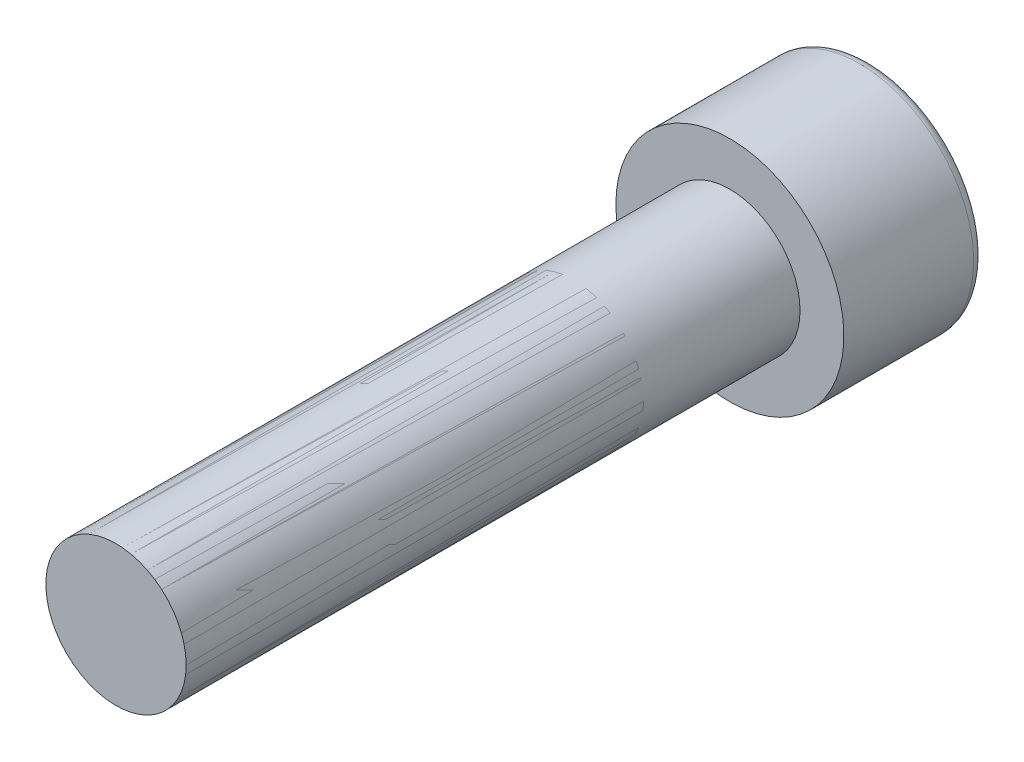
ISO-10303-21;
HEADER;
FILE_DESCRIPTION(('STEP AP214'),'2;1');
FILE_NAME('part.step','',(''),(''),'','','');
FILE_SCHEMA(('AUTOMOTIVE_DESIGN { 1 0 10303 214 1 1 1 1 }'));
ENDSEC;
DATA;
#1=APPLICATION_CONTEXT('core data for automotive mechanical design processes');
#2=APPLICATION_PROTOCOL_DEFINITION('international standard','automotive_design',2000,#1);
#3=PRODUCT_CONTEXT('',#1,'mechanical');
#4=PRODUCT('Part','Part','',(#3));
#5=PRODUCT_RELATED_PRODUCT_CATEGORY('part','',(#4));
#6=PRODUCT_DEFINITION_FORMATION('','',#4);
#7=PRODUCT_DEFINITION_CONTEXT('part definition',#1,'design');
#8=PRODUCT_DEFINITION('design','',#6,#7);
#9=PRODUCT_DEFINITION_SHAPE('','',#8);
#10=(LENGTH_UNIT() NAMED_UNIT(*) SI_UNIT(.MILLI.,.METRE.));
#11=(NAMED_UNIT(*) PLANE_ANGLE_UNIT() SI_UNIT($,.RADIAN.));
#12=(NAMED_UNIT(*) SI_UNIT($,.STERADIAN.) SOLID_ANGLE_UNIT());
#13=UNCERTAINTY_MEASURE_WITH_UNIT(LENGTH_MEASURE(1.E-05),#10,'distance_accuracy_value','');
#14=(GEOMETRIC_REPRESENTATION_CONTEXT(3) GLOBAL_UNCERTAINTY_ASSIGNED_CONTEXT((#13)) GLOBAL_UNIT_ASSIGNED_CONTEXT((#10,
#11,#12)) REPRESENTATION_CONTEXT('',''));
#15=CARTESIAN_POINT('',(0.,0.,0.));
#16=DIRECTION('',(0.,0.,1.));
#17=DIRECTION('',(1.,0.,0.));
#18=AXIS2_PLACEMENT_3D('',#15,#16,#17);
#19=CARTESIAN_POINT('',(0.,0.,35.));
#20=DIRECTION('',(0.,0.,1.));
#21=DIRECTION('',(1.,0.,0.));
#22=AXIS2_PLACEMENT_3D('',#19,#20,#21);
#23=CYLINDRICAL_SURFACE('',#22,4.);
#24=CARTESIAN_POINT('',(0.,0.,0.));
#25=DIRECTION('',(0.,0.,1.));
#26=DIRECTION('',(1.,0.,0.));
#27=AXIS2_PLACEMENT_3D('',#24,#25,#26);
#28=CIRCLE('',#27,4.);
#29=CARTESIAN_POINT('',(4.,0.,0.));
#30=VERTEX_POINT('',#29);
#31=EDGE_CURVE('P0_E18',#30,#30,#28,.T.);
#32=ORIENTED_EDGE('',*,*,#31,.T.);
#33=EDGE_LOOP('',(#32));
#34=FACE_BOUND('',#33,.T.);
#35=CARTESIAN_POINT('',(0.,0.,35.));
#36=DIRECTION('',(0.,0.,1.));
#37=DIRECTION('',(1.,0.,0.));
#38=AXIS2_PLACEMENT_3D('',#35,#36,#37);
#39=CIRCLE('',#38,4.);
#40=CARTESIAN_POINT('',(4.,0.,35.));
#41=VERTEX_POINT('',#40);
#42=EDGE_CURVE('P0_E10',#41,#41,#39,.F.);
#43=ORIENTED_EDGE('',*,*,#42,.T.);
#44=EDGE_LOOP('',(#43));
#45=FACE_BOUND('',#44,.T.);
#46=ADVANCED_FACE('P0_F15',(#34,#45),#23,.T.);
#47=CARTESIAN_POINT('',(0.,0.,0.));
#48=DIRECTION('',(0.,0.,1.));
#49=DIRECTION('',(1.,0.,0.));
#50=AXIS2_PLACEMENT_3D('',#47,#48,#49);
#51=PLANE('',#50);
#52=ORIENTED_EDGE('',*,*,#31,.F.);
#53=EDGE_LOOP('',(#52));
#54=FACE_BOUND('',#53,.T.);
#55=ADVANCED_FACE('P0_F16',(#54),#51,.F.);
#56=OPEN_SHELL('',(#46,#55));
#57=SHELL_BASED_SURFACE_MODEL('P0_B1',(#56));
#58=CARTESIAN_POINT('',(0.,0.,-2.666666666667));
#59=DIRECTION('',(0.,0.,-1.));
#60=DIRECTION('',(-1.,0.,0.));
#61=AXIS2_PLACEMENT_3D('',#58,#59,#60);
#62=PLANE('',#61);
#63=DIRECTION('',(-0.500000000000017,0.866025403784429,0.));
#64=VECTOR('',#63,1.);
#65=CARTESIAN_POINT('',(1.732050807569,3.,-2.666666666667));
#66=LINE('',#65,#64);
#67=CARTESIAN_POINT('',(1.732050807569,3.,-2.666666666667));
#68=VERTEX_POINT('',#67);
#69=CARTESIAN_POINT('',(3.46410161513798,0.,-2.666666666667));
#70=VERTEX_POINT('',#69);
#71=EDGE_CURVE('P1_E65',#68,#70,#66,.F.);
#72=ORIENTED_EDGE('',*,*,#71,.T.);
#73=DIRECTION('',(0.500000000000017,0.866025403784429,0.));
#74=VECTOR('',#73,1.);
#75=CARTESIAN_POINT('',(3.464101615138,0.,-2.666666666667));
#76=LINE('',#75,#74);
#77=CARTESIAN_POINT('',(1.73205080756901,-3.00000000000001,-2.666666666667));
#78=VERTEX_POINT('',#77);
#79=EDGE_CURVE('P1_E167',#70,#78,#76,.F.);
#80=ORIENTED_EDGE('',*,*,#79,.T.);
#81=DIRECTION('',(1.,0.,0.));
#82=VECTOR('',#81,1.);
#83=CARTESIAN_POINT('',(1.732050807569,-3.,-2.666666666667));
#84=LINE('',#83,#82);
#85=CARTESIAN_POINT('',(-1.732050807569,-3.,-2.666666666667));
#86=VERTEX_POINT('',#85);
#87=EDGE_CURVE('P1_E173',#78,#86,#84,.F.);
#88=ORIENTED_EDGE('',*,*,#87,.T.);
#89=DIRECTION('',(0.500000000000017,-0.866025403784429,0.));
#90=VECTOR('',#89,1.);
#91=CARTESIAN_POINT('',(-1.732050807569,-3.,-2.666666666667));
#92=LINE('',#91,#90);
#93=CARTESIAN_POINT('',(-3.46410161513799,0.,-2.666666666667));
#94=VERTEX_POINT('',#93);
#95=EDGE_CURVE('P1_E178',#86,#94,#92,.F.);
#96=ORIENTED_EDGE('',*,*,#95,.T.);
#97=DIRECTION('',(-0.500000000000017,-0.866025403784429,0.));
#98=VECTOR('',#97,1.);
#99=CARTESIAN_POINT('',(-3.464101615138,0.,-2.666666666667));
#100=LINE('',#99,#98);
#101=CARTESIAN_POINT('',(-1.73205080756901,3.00000000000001,-2.666666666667));
#102=VERTEX_POINT('',#101);
#103=EDGE_CURVE('P1_E61',#94,#102,#100,.F.);
#104=ORIENTED_EDGE('',*,*,#103,.T.);
#105=DIRECTION('',(1.,0.,0.));
#106=VECTOR('',#105,1.);
#107=CARTESIAN_POINT('',(-1.732050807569,3.,-2.666666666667));
#108=LINE('',#107,#106);
#109=EDGE_CURVE('P1_E63',#102,#68,#108,.T.);
#110=ORIENTED_EDGE('',*,*,#109,.T.);
#111=EDGE_LOOP('',(#72,#80,#88,#96,#104,#110));
#112=FACE_BOUND('',#111,.T.);
#113=ADVANCED_FACE('P1_F17',(#112),#62,.T.);
#114=CARTESIAN_POINT('',(1.732050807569,3.,-8.));
#115=DIRECTION('',(0.866025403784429,0.500000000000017,0.));
#116=DIRECTION('',(-0.500000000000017,0.866025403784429,0.));
#117=AXIS2_PLACEMENT_3D('',#114,#115,#116);
#118=PLANE('',#117);
#119=ORIENTED_EDGE('',*,*,#71,.F.);
#120=DIRECTION('',(0.,0.,1.));
#121=VECTOR('',#120,1.);
#122=CARTESIAN_POINT('',(1.732050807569,3.,-8.));
#123=LINE('',#122,#121);
#124=CARTESIAN_POINT('',(1.732050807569,3.,-8.));
#125=VERTEX_POINT('',#124);
#126=EDGE_CURVE('P1_E71',#68,#125,#123,.F.);
#127=ORIENTED_EDGE('',*,*,#126,.T.);
#128=DIRECTION('',(-0.500000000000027,0.866025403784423,0.));
#129=VECTOR('',#128,1.);
#130=CARTESIAN_POINT('',(3.464101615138,0.,-8.));
#131=LINE('',#130,#129);
#132=CARTESIAN_POINT('',(3.46410161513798,0.,-8.));
#133=VERTEX_POINT('',#132);
#134=EDGE_CURVE('P1_E153',#133,#125,#131,.T.);
#135=ORIENTED_EDGE('',*,*,#134,.F.);
#136=DIRECTION('',(0.,0.,1.));
#137=VECTOR('',#136,1.);
#138=CARTESIAN_POINT('',(3.464101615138,0.,-8.));
#139=LINE('',#138,#137);
#140=EDGE_CURVE('P1_E79',#133,#70,#139,.T.);
#141=ORIENTED_EDGE('',*,*,#140,.T.);
#142=EDGE_LOOP('',(#119,#127,#135,#141));
#143=FACE_BOUND('',#142,.T.);
#144=ADVANCED_FACE('P1_F75',(#143),#118,.F.);
#145=CARTESIAN_POINT('',(-1.732050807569,3.,-8.));
#146=DIRECTION('',(0.,1.,0.));
#147=DIRECTION('',(0.,0.,1.));
#148=AXIS2_PLACEMENT_3D('',#145,#146,#147);
#149=PLANE('',#148);
#150=ORIENTED_EDGE('',*,*,#109,.F.);
#151=DIRECTION('',(0.,0.,1.));
#152=VECTOR('',#151,1.);
#153=CARTESIAN_POINT('',(-1.73205080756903,3.00000000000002,-8.));
#154=LINE('',#153,#152);
#155=CARTESIAN_POINT('',(-1.73205080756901,3.00000000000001,-8.));
#156=VERTEX_POINT('',#155);
#157=EDGE_CURVE('P1_E87',#102,#156,#154,.F.);
#158=ORIENTED_EDGE('',*,*,#157,.T.);
#159=DIRECTION('',(-1.,0.,0.));
#160=VECTOR('',#159,1.);
#161=CARTESIAN_POINT('',(0.,3.,-8.));
#162=LINE('',#161,#160);
#163=EDGE_CURVE('P1_E84',#125,#156,#162,.T.);
#164=ORIENTED_EDGE('',*,*,#163,.F.);
#165=ORIENTED_EDGE('',*,*,#126,.F.);
#166=EDGE_LOOP('',(#150,#158,#164,#165));
#167=FACE_BOUND('',#166,.T.);
#168=ADVANCED_FACE('P1_F82',(#167),#149,.F.);
#169=CARTESIAN_POINT('',(-3.464101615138,0.,-8.));
#170=DIRECTION('',(-0.866025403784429,0.500000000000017,0.));
#171=DIRECTION('',(-0.500000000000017,-0.866025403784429,0.));
#172=AXIS2_PLACEMENT_3D('',#169,#170,#171);
#173=PLANE('',#172);
#174=ORIENTED_EDGE('',*,*,#103,.F.);
#175=DIRECTION('',(0.,0.,1.));
#176=VECTOR('',#175,1.);
#177=CARTESIAN_POINT('',(-3.46410161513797,0.,-8.));
#178=LINE('',#177,#176);
#179=CARTESIAN_POINT('',(-3.46410161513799,0.,-8.));
#180=VERTEX_POINT('',#179);
#181=EDGE_CURVE('P1_E175',#94,#180,#178,.F.);
#182=ORIENTED_EDGE('',*,*,#181,.T.);
#183=DIRECTION('',(-0.500000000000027,-0.866025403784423,0.));
#184=VECTOR('',#183,1.);
#185=CARTESIAN_POINT('',(-1.732050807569,3.,-8.));
#186=LINE('',#185,#184);
#187=EDGE_CURVE('P1_E149',#156,#180,#186,.T.);
#188=ORIENTED_EDGE('',*,*,#187,.F.);
#189=ORIENTED_EDGE('',*,*,#157,.F.);
#190=EDGE_LOOP('',(#174,#182,#188,#189));
#191=FACE_BOUND('',#190,.T.);
#192=ADVANCED_FACE('P1_F184',(#191),#173,.F.);
#193=CARTESIAN_POINT('',(-1.732050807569,-3.,-8.));
#194=DIRECTION('',(-0.866025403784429,-0.500000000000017,0.));
#195=DIRECTION('',(0.500000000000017,-0.866025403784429,0.));
#196=AXIS2_PLACEMENT_3D('',#193,#194,#195);
#197=PLANE('',#196);
#198=ORIENTED_EDGE('',*,*,#95,.F.);
#199=DIRECTION('',(0.,0.,-1.));
#200=VECTOR('',#199,1.);
#201=CARTESIAN_POINT('',(-1.732050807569,-3.,-8.));
#202=LINE('',#201,#200);
#203=CARTESIAN_POINT('',(-1.732050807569,-3.,-8.));
#204=VERTEX_POINT('',#203);
#205=EDGE_CURVE('P1_E170',#86,#204,#202,.T.);
#206=ORIENTED_EDGE('',*,*,#205,.T.);
#207=DIRECTION('',(0.500000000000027,-0.866025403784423,0.));
#208=VECTOR('',#207,1.);
#209=CARTESIAN_POINT('',(-3.464101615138,0.,-8.));
#210=LINE('',#209,#208);
#211=EDGE_CURVE('P1_E146',#180,#204,#210,.T.);
#212=ORIENTED_EDGE('',*,*,#211,.F.);
#213=ORIENTED_EDGE('',*,*,#181,.F.);
#214=EDGE_LOOP('',(#198,#206,#212,#213));
#215=FACE_BOUND('',#214,.T.);
#216=ADVANCED_FACE('P1_F198',(#215),#197,.F.);
#217=CARTESIAN_POINT('',(1.732050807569,-3.,-8.));
#218=DIRECTION('',(0.,-1.,0.));
#219=DIRECTION('',(0.,0.,-1.));
#220=AXIS2_PLACEMENT_3D('',#217,#218,#219);
#221=PLANE('',#220);
#222=ORIENTED_EDGE('',*,*,#87,.F.);
#223=DIRECTION('',(0.,0.,1.));
#224=VECTOR('',#223,1.);
#225=CARTESIAN_POINT('',(1.73205080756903,-3.00000000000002,-8.));
#226=LINE('',#225,#224);
#227=CARTESIAN_POINT('',(1.73205080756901,-3.00000000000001,-8.));
#228=VERTEX_POINT('',#227);
#229=EDGE_CURVE('P1_E155',#78,#228,#226,.F.);
#230=ORIENTED_EDGE('',*,*,#229,.T.);
#231=DIRECTION('',(-1.,0.,0.));
#232=VECTOR('',#231,1.);
#233=CARTESIAN_POINT('',(0.,-3.,-8.));
#234=LINE('',#233,#232);
#235=EDGE_CURVE('P1_E143',#204,#228,#234,.F.);
#236=ORIENTED_EDGE('',*,*,#235,.F.);
#237=ORIENTED_EDGE('',*,*,#205,.F.);
#238=EDGE_LOOP('',(#222,#230,#236,#237));
#239=FACE_BOUND('',#238,.T.);
#240=ADVANCED_FACE('P1_F194',(#239),#221,.F.);
#241=CARTESIAN_POINT('',(3.464101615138,0.,-8.));
#242=DIRECTION('',(0.866025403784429,-0.500000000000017,0.));
#243=DIRECTION('',(0.500000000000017,0.866025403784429,0.));
#244=AXIS2_PLACEMENT_3D('',#241,#242,#243);
#245=PLANE('',#244);
#246=ORIENTED_EDGE('',*,*,#79,.F.);
#247=ORIENTED_EDGE('',*,*,#140,.F.);
#248=DIRECTION('',(0.500000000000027,0.866025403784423,0.));
#249=VECTOR('',#248,1.);
#250=CARTESIAN_POINT('',(1.732050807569,-3.,-8.));
#251=LINE('',#250,#249);
#252=EDGE_CURVE('P1_E135',#228,#133,#251,.T.);
#253=ORIENTED_EDGE('',*,*,#252,.F.);
#254=ORIENTED_EDGE('',*,*,#229,.F.);
#255=EDGE_LOOP('',(#246,#247,#253,#254));
#256=FACE_BOUND('',#255,.T.);
#257=ADVANCED_FACE('P1_F126',(#256),#245,.F.);
#258=CARTESIAN_POINT('',(0.,0.,-8.));
#259=DIRECTION('',(0.,0.,-1.));
#260=DIRECTION('',(-1.,0.,0.));
#261=AXIS2_PLACEMENT_3D('',#258,#259,#260);
#262=PLANE('',#261);
#263=ORIENTED_EDGE('',*,*,#235,.T.);
#264=ORIENTED_EDGE('',*,*,#252,.T.);
#265=ORIENTED_EDGE('',*,*,#134,.T.);
#266=ORIENTED_EDGE('',*,*,#163,.T.);
#267=ORIENTED_EDGE('',*,*,#187,.T.);
#268=ORIENTED_EDGE('',*,*,#211,.T.);
#269=EDGE_LOOP('',(#263,#264,#265,#266,#267,#268));
#270=FACE_BOUND('',#269,.T.);
#271=CARTESIAN_POINT('',(0.,0.,-7.99999999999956));
#272=DIRECTION('',(0.,0.,1.));
#273=DIRECTION('',(1.,0.,0.));
#274=AXIS2_PLACEMENT_3D('',#271,#272,#273);
#275=CIRCLE('',#274,5.899999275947);
#276=CARTESIAN_POINT('',(5.8999994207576,0.,-7.99999999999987));
#277=VERTEX_POINT('',#276);
#278=CARTESIAN_POINT('',(-5.8999994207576,0.,-7.99999999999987));
#279=VERTEX_POINT('',#278);
#280=EDGE_CURVE('P1_E36',#277,#279,#275,.T.);
#281=ORIENTED_EDGE('',*,*,#280,.F.);
#282=CARTESIAN_POINT('',(0.,0.,-7.99999999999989));
#283=DIRECTION('',(0.,0.,1.));
#284=DIRECTION('',(-1.,0.,0.));
#285=AXIS2_PLACEMENT_3D('',#282,#283,#284);
#286=CIRCLE('',#285,5.8999996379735);
#287=EDGE_CURVE('P1_E101',#279,#277,#286,.T.);
#288=ORIENTED_EDGE('',*,*,#287,.F.);
#289=EDGE_LOOP('',(#281,#288));
#290=FACE_BOUND('',#289,.T.);
#291=ADVANCED_FACE('P1_F116',(#270,#290),#262,.T.);
#292=CARTESIAN_POINT('',(0.,0.,-7.4));
#293=DIRECTION('',(0.,0.,-1.));
#294=DIRECTION('',(0.999938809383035,0.0110624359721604,0.));
#295=AXIS2_PLACEMENT_3D('',#292,#293,#294);
#296=TOROIDAL_SURFACE('',#295,5.9,0.6);
#297=CARTESIAN_POINT('',(0.,0.,-7.4));
#298=DIRECTION('',(0.,0.,-1.));
#299=DIRECTION('',(-1.,0.,0.));
#300=AXIS2_PLACEMENT_3D('',#297,#298,#299);
#301=CIRCLE('',#300,6.5);
#302=CARTESIAN_POINT('',(-6.5,0.,-7.4));
#303=VERTEX_POINT('',#302);
#304=EDGE_CURVE('P1_E97',#303,#303,#301,.F.);
#305=ORIENTED_EDGE('',*,*,#304,.F.);
#306=EDGE_LOOP('',(#305));
#307=FACE_BOUND('',#306,.T.);
#308=ORIENTED_EDGE('',*,*,#287,.T.);
#309=ORIENTED_EDGE('',*,*,#280,.T.);
#310=EDGE_LOOP('',(#308,#309));
#311=FACE_BOUND('',#310,.T.);
#312=ADVANCED_FACE('P1_F125',(#307,#311),#296,.T.);
#313=CARTESIAN_POINT('',(0.,0.,0.));
#314=DIRECTION('',(0.,0.,-1.));
#315=DIRECTION('',(-1.,0.,0.));
#316=AXIS2_PLACEMENT_3D('',#313,#314,#315);
#317=CYLINDRICAL_SURFACE('',#316,6.5);
#318=CARTESIAN_POINT('',(0.,0.,0.));
#319=DIRECTION('',(0.,0.,-1.));
#320=DIRECTION('',(-1.,0.,0.));
#321=AXIS2_PLACEMENT_3D('',#318,#319,#320);
#322=CIRCLE('',#321,6.5);
#323=CARTESIAN_POINT('',(-6.5,0.,0.));
#324=VERTEX_POINT('',#323);
#325=EDGE_CURVE('P1_E95',#324,#324,#322,.T.);
#326=ORIENTED_EDGE('',*,*,#325,.T.);
#327=EDGE_LOOP('',(#326));
#328=FACE_BOUND('',#327,.T.);
#329=ORIENTED_EDGE('',*,*,#304,.T.);
#330=EDGE_LOOP('',(#329));
#331=FACE_BOUND('',#330,.T.);
#332=ADVANCED_FACE('P1_F244',(#328,#331),#317,.T.);
#333=CARTESIAN_POINT('',(0.,0.,0.));
#334=DIRECTION('',(0.,0.,-1.));
#335=DIRECTION('',(-1.,0.,0.));
#336=AXIS2_PLACEMENT_3D('',#333,#334,#335);
#337=PLANE('',#336);
#338=CARTESIAN_POINT('',(0.,0.,0.));
#339=DIRECTION('',(0.,0.,1.));
#340=DIRECTION('',(1.,0.,0.));
#341=AXIS2_PLACEMENT_3D('',#338,#339,#340);
#342=CIRCLE('',#341,4.);
#343=CARTESIAN_POINT('',(4.,0.,0.));
#344=VERTEX_POINT('',#343);
#345=EDGE_CURVE('P1_E91',#344,#344,#342,.T.);
#346=ORIENTED_EDGE('',*,*,#345,.F.);
#347=EDGE_LOOP('',(#346));
#348=FACE_BOUND('',#347,.T.);
#349=ORIENTED_EDGE('',*,*,#325,.F.);
#350=EDGE_LOOP('',(#349));
#351=FACE_BOUND('',#350,.T.);
#352=ADVANCED_FACE('P1_F239',(#348,#351),#337,.F.);
#353=CARTESIAN_POINT('',(0.,0.,0.));
#354=DIRECTION('',(0.,0.,1.));
#355=DIRECTION('',(1.,0.,0.));
#356=AXIS2_PLACEMENT_3D('',#353,#354,#355);
#357=CYLINDRICAL_SURFACE('',#356,4.);
#358=CARTESIAN_POINT('',(0.,0.,6.07346573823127));
#359=DIRECTION('',(0.,0.,-1.));
#360=DIRECTION('',(1.,0.,0.));
#361=AXIS2_PLACEMENT_3D('',#358,#359,#360);
#362=CIRCLE('',#361,4.00000000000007);
#363=CARTESIAN_POINT('',(4.00000000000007,0.,6.07346573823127));
#364=VERTEX_POINT('',#363);
#365=EDGE_CURVE('P1_E94',#364,#364,#362,.T.);
#366=ORIENTED_EDGE('',*,*,#365,.T.);
#367=EDGE_LOOP('',(#366));
#368=FACE_BOUND('',#367,.T.);
#369=ORIENTED_EDGE('',*,*,#345,.T.);
#370=EDGE_LOOP('',(#369));
#371=FACE_BOUND('',#370,.T.);
#372=ADVANCED_FACE('P1_F226',(#368,#371),#357,.T.);
#373=CARTESIAN_POINT('',(0.,0.,7.5));
#374=DIRECTION('',(0.,0.,-1.));
#375=DIRECTION('',(1.,0.,0.));
#376=AXIS2_PLACEMENT_3D('',#373,#374,#375);
#377=TOROIDAL_SURFACE('',#376,4.375,1.475);
#378=ORIENTED_EDGE('',*,*,#365,.F.);
#379=EDGE_LOOP('',(#378));
#380=FACE_BOUND('',#379,.T.);
#381=CARTESIAN_POINT('',(0.,0.,8.926534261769));
#382=DIRECTION('',(0.,0.,1.));
#383=DIRECTION('',(1.,0.,0.));
#384=AXIS2_PLACEMENT_3D('',#381,#382,#383);
#385=CIRCLE('',#384,4.);
#386=CARTESIAN_POINT('',(4.,0.,8.926534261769));
#387=VERTEX_POINT('',#386);
#388=EDGE_CURVE('P1_E28',#387,#387,#385,.T.);
#389=ORIENTED_EDGE('',*,*,#388,.F.);
#390=EDGE_LOOP('',(#389));
#391=FACE_BOUND('',#390,.T.);
#392=ADVANCED_FACE('P1_F218',(#380,#391),#377,.F.);
#393=CARTESIAN_POINT('',(0.,0.,35.));
#394=DIRECTION('',(0.,0.,1.));
#395=DIRECTION('',(1.,0.,0.));
#396=AXIS2_PLACEMENT_3D('',#393,#394,#395);
#397=PLANE('',#396);
#398=CARTESIAN_POINT('',(0.,0.,35.));
#399=DIRECTION('',(0.,0.,1.));
#400=DIRECTION('',(1.,0.,0.));
#401=AXIS2_PLACEMENT_3D('',#398,#399,#400);
#402=CIRCLE('',#401,4.);
#403=CARTESIAN_POINT('',(4.,0.,35.));
#404=VERTEX_POINT('',#403);
#405=EDGE_CURVE('P1_E11',#404,#404,#402,.F.);
#406=ORIENTED_EDGE('',*,*,#405,.F.);
#407=EDGE_LOOP('',(#406));
#408=FACE_BOUND('',#407,.T.);
#409=ADVANCED_FACE('P1_F212',(#408),#397,.T.);
#410=CARTESIAN_POINT('',(0.,0.,0.));
#411=DIRECTION('',(0.,0.,1.));
#412=DIRECTION('',(1.,0.,0.));
#413=AXIS2_PLACEMENT_3D('',#410,#411,#412);
#414=CYLINDRICAL_SURFACE('',#413,4.);
#415=ORIENTED_EDGE('',*,*,#405,.T.);
#416=EDGE_LOOP('',(#415));
#417=FACE_BOUND('',#416,.T.);
#418=ORIENTED_EDGE('',*,*,#388,.T.);
#419=EDGE_LOOP('',(#418));
#420=FACE_BOUND('',#419,.T.);
#421=ADVANCED_FACE('P1_F210',(#417,#420),#414,.T.);
#422=CLOSED_SHELL('',(#113,#144,#168,#192,#216,#240,#257,#291,#312,#332,#352,#372,#392,#409,#421));
#423=MANIFOLD_SOLID_BREP('P1_B1',#422);
#424=ADVANCED_BREP_SHAPE_REPRESENTATION('',(#18,#423),#14);
#425=MANIFOLD_SURFACE_SHAPE_REPRESENTATION('',(#18,#57),#14);
#426=SHAPE_REPRESENTATION('',(#18),#14);
#427=SHAPE_DEFINITION_REPRESENTATION(#9,#426);
#428=SHAPE_REPRESENTATION_RELATIONSHIP('','',#426,#424);
#429=SHAPE_REPRESENTATION_RELATIONSHIP('','',#426,#425);
ENDSEC;
END-ISO-10303-21;
